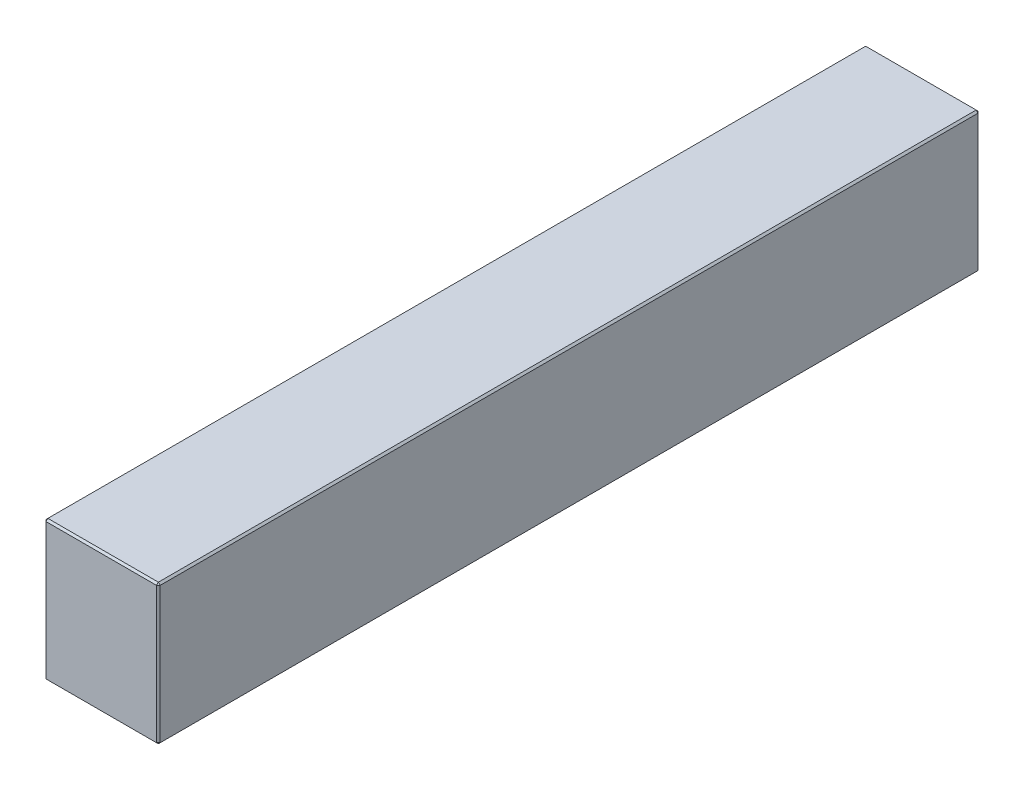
ISO-10303-21;
HEADER;
FILE_DESCRIPTION(('STEP AP214'),'2;1');
FILE_NAME('part.step','',(''),(''),'','','');
FILE_SCHEMA(('AUTOMOTIVE_DESIGN { 1 0 10303 214 1 1 1 1 }'));
ENDSEC;
DATA;
#1=APPLICATION_CONTEXT('core data for automotive mechanical design processes');
#2=APPLICATION_PROTOCOL_DEFINITION('international standard','automotive_design',2000,#1);
#3=PRODUCT_CONTEXT('',#1,'mechanical');
#4=PRODUCT('Part','Part','',(#3));
#5=PRODUCT_RELATED_PRODUCT_CATEGORY('part','',(#4));
#6=PRODUCT_DEFINITION_FORMATION('','',#4);
#7=PRODUCT_DEFINITION_CONTEXT('part definition',#1,'design');
#8=PRODUCT_DEFINITION('design','',#6,#7);
#9=PRODUCT_DEFINITION_SHAPE('','',#8);
#10=(LENGTH_UNIT() NAMED_UNIT(*) SI_UNIT(.MILLI.,.METRE.));
#11=(NAMED_UNIT(*) PLANE_ANGLE_UNIT() SI_UNIT($,.RADIAN.));
#12=(NAMED_UNIT(*) SI_UNIT($,.STERADIAN.) SOLID_ANGLE_UNIT());
#13=UNCERTAINTY_MEASURE_WITH_UNIT(LENGTH_MEASURE(1.E-05),#10,'distance_accuracy_value','');
#14=(GEOMETRIC_REPRESENTATION_CONTEXT(3) GLOBAL_UNCERTAINTY_ASSIGNED_CONTEXT((#13)) GLOBAL_UNIT_ASSIGNED_CONTEXT((#10,
#11,#12)) REPRESENTATION_CONTEXT('',''));
#15=CARTESIAN_POINT('',(0.,0.,0.));
#16=DIRECTION('',(0.,0.,1.));
#17=DIRECTION('',(1.,0.,0.));
#18=AXIS2_PLACEMENT_3D('',#15,#16,#17);
#19=CARTESIAN_POINT('',(-31.,76.,223.));
#20=DIRECTION('',(1.,0.,0.));
#21=DIRECTION('',(0.,0.,-1.));
#22=AXIS2_PLACEMENT_3D('',#19,#20,#21);
#23=PLANE('',#22);
#24=DIRECTION('',(0.,-1.,0.));
#25=VECTOR('',#24,1.);
#26=CARTESIAN_POINT('',(-31.,76.,-222.));
#27=LINE('',#26,#25);
#28=CARTESIAN_POINT('',(-31.,75.,-222.));
#29=VERTEX_POINT('',#28);
#30=CARTESIAN_POINT('',(-31.,1.00000000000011,-222.));
#31=VERTEX_POINT('',#30);
#32=EDGE_CURVE('E114',#29,#31,#27,.T.);
#33=ORIENTED_EDGE('',*,*,#32,.T.);
#34=DIRECTION('',(0.,0.,1.));
#35=VECTOR('',#34,1.);
#36=CARTESIAN_POINT('',(-31.,1.00000000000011,223.));
#37=LINE('',#36,#35);
#38=CARTESIAN_POINT('',(-31.,1.00000000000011,222.));
#39=VERTEX_POINT('',#38);
#40=EDGE_CURVE('E110',#31,#39,#37,.T.);
#41=ORIENTED_EDGE('',*,*,#40,.T.);
#42=DIRECTION('',(0.,1.,0.));
#43=VECTOR('',#42,1.);
#44=CARTESIAN_POINT('',(-31.,76.,222.));
#45=LINE('',#44,#43);
#46=CARTESIAN_POINT('',(-31.,75.,222.));
#47=VERTEX_POINT('',#46);
#48=EDGE_CURVE('E103',#39,#47,#45,.T.);
#49=ORIENTED_EDGE('',*,*,#48,.T.);
#50=DIRECTION('',(0.,0.,-1.));
#51=VECTOR('',#50,1.);
#52=CARTESIAN_POINT('',(-31.,75.,-223.));
#53=LINE('',#52,#51);
#54=EDGE_CURVE('E107',#47,#29,#53,.T.);
#55=ORIENTED_EDGE('',*,*,#54,.T.);
#56=EDGE_LOOP('',(#33,#41,#49,#55));
#57=FACE_BOUND('',#56,.T.);
#58=ADVANCED_FACE('F15',(#57),#23,.F.);
#59=CARTESIAN_POINT('',(31.,76.,223.));
#60=DIRECTION('',(0.,0.,-1.));
#61=DIRECTION('',(-1.,0.,0.));
#62=AXIS2_PLACEMENT_3D('',#59,#60,#61);
#63=PLANE('',#62);
#64=DIRECTION('',(-1.,0.,0.));
#65=VECTOR('',#64,1.);
#66=CARTESIAN_POINT('',(-31.,75.,223.));
#67=LINE('',#66,#65);
#68=CARTESIAN_POINT('',(30.,75.,223.));
#69=VERTEX_POINT('',#68);
#70=CARTESIAN_POINT('',(-30.,75.,223.));
#71=VERTEX_POINT('',#70);
#72=EDGE_CURVE('E164',#69,#71,#67,.T.);
#73=ORIENTED_EDGE('',*,*,#72,.T.);
#74=DIRECTION('',(0.,-1.,0.));
#75=VECTOR('',#74,1.);
#76=CARTESIAN_POINT('',(-30.,76.,223.));
#77=LINE('',#76,#75);
#78=CARTESIAN_POINT('',(-30.,1.00000000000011,223.));
#79=VERTEX_POINT('',#78);
#80=EDGE_CURVE('E122',#71,#79,#77,.T.);
#81=ORIENTED_EDGE('',*,*,#80,.T.);
#82=DIRECTION('',(1.,0.,0.));
#83=VECTOR('',#82,1.);
#84=CARTESIAN_POINT('',(31.,1.00000000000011,223.));
#85=LINE('',#84,#83);
#86=CARTESIAN_POINT('',(30.,1.00000000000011,223.));
#87=VERTEX_POINT('',#86);
#88=EDGE_CURVE('E168',#79,#87,#85,.T.);
#89=ORIENTED_EDGE('',*,*,#88,.T.);
#90=DIRECTION('',(0.,1.,0.));
#91=VECTOR('',#90,1.);
#92=CARTESIAN_POINT('',(30.,76.,223.));
#93=LINE('',#92,#91);
#94=EDGE_CURVE('E166',#87,#69,#93,.T.);
#95=ORIENTED_EDGE('',*,*,#94,.T.);
#96=EDGE_LOOP('',(#73,#81,#89,#95));
#97=FACE_BOUND('',#96,.T.);
#98=ADVANCED_FACE('F275',(#97),#63,.F.);
#99=CARTESIAN_POINT('',(31.,76.,223.));
#100=DIRECTION('',(-1.,0.,0.));
#101=DIRECTION('',(0.,0.,1.));
#102=AXIS2_PLACEMENT_3D('',#99,#100,#101);
#103=PLANE('',#102);
#104=DIRECTION('',(0.,0.,-1.));
#105=VECTOR('',#104,1.);
#106=CARTESIAN_POINT('',(31.,1.00000000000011,223.));
#107=LINE('',#106,#105);
#108=CARTESIAN_POINT('',(31.,1.00000000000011,222.));
#109=VERTEX_POINT('',#108);
#110=CARTESIAN_POINT('',(31.,1.00000000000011,-222.));
#111=VERTEX_POINT('',#110);
#112=EDGE_CURVE('E159',#109,#111,#107,.T.);
#113=ORIENTED_EDGE('',*,*,#112,.T.);
#114=DIRECTION('',(0.,1.,0.));
#115=VECTOR('',#114,1.);
#116=CARTESIAN_POINT('',(31.,76.,-222.));
#117=LINE('',#116,#115);
#118=CARTESIAN_POINT('',(31.,75.,-222.));
#119=VERTEX_POINT('',#118);
#120=EDGE_CURVE('E161',#111,#119,#117,.T.);
#121=ORIENTED_EDGE('',*,*,#120,.T.);
#122=DIRECTION('',(0.,0.,1.));
#123=VECTOR('',#122,1.);
#124=CARTESIAN_POINT('',(31.,75.,223.));
#125=LINE('',#124,#123);
#126=CARTESIAN_POINT('',(31.,75.,222.));
#127=VERTEX_POINT('',#126);
#128=EDGE_CURVE('E155',#119,#127,#125,.T.);
#129=ORIENTED_EDGE('',*,*,#128,.T.);
#130=DIRECTION('',(0.,-1.,0.));
#131=VECTOR('',#130,1.);
#132=CARTESIAN_POINT('',(31.,76.,222.));
#133=LINE('',#132,#131);
#134=EDGE_CURVE('E157',#127,#109,#133,.T.);
#135=ORIENTED_EDGE('',*,*,#134,.T.);
#136=EDGE_LOOP('',(#113,#121,#129,#135));
#137=FACE_BOUND('',#136,.T.);
#138=ADVANCED_FACE('F254',(#137),#103,.F.);
#139=CARTESIAN_POINT('',(31.,76.,-223.));
#140=DIRECTION('',(0.,0.,1.));
#141=DIRECTION('',(1.,0.,0.));
#142=AXIS2_PLACEMENT_3D('',#139,#140,#141);
#143=PLANE('',#142);
#144=DIRECTION('',(0.,-1.,0.));
#145=VECTOR('',#144,1.);
#146=CARTESIAN_POINT('',(30.,76.,-223.));
#147=LINE('',#146,#145);
#148=CARTESIAN_POINT('',(30.,75.,-223.));
#149=VERTEX_POINT('',#148);
#150=CARTESIAN_POINT('',(30.,1.00000000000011,-223.));
#151=VERTEX_POINT('',#150);
#152=EDGE_CURVE('E148',#149,#151,#147,.T.);
#153=ORIENTED_EDGE('',*,*,#152,.T.);
#154=DIRECTION('',(-1.,0.,0.));
#155=VECTOR('',#154,1.);
#156=CARTESIAN_POINT('',(31.,1.00000000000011,-223.));
#157=LINE('',#156,#155);
#158=CARTESIAN_POINT('',(-30.,1.00000000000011,-223.));
#159=VERTEX_POINT('',#158);
#160=EDGE_CURVE('E153',#151,#159,#157,.T.);
#161=ORIENTED_EDGE('',*,*,#160,.T.);
#162=DIRECTION('',(0.,1.,0.));
#163=VECTOR('',#162,1.);
#164=CARTESIAN_POINT('',(-30.,76.,-223.));
#165=LINE('',#164,#163);
#166=CARTESIAN_POINT('',(-30.,75.,-223.));
#167=VERTEX_POINT('',#166);
#168=EDGE_CURVE('E150',#159,#167,#165,.T.);
#169=ORIENTED_EDGE('',*,*,#168,.T.);
#170=DIRECTION('',(1.,0.,0.));
#171=VECTOR('',#170,1.);
#172=CARTESIAN_POINT('',(31.,75.,-223.));
#173=LINE('',#172,#171);
#174=EDGE_CURVE('E146',#167,#149,#173,.T.);
#175=ORIENTED_EDGE('',*,*,#174,.T.);
#176=EDGE_LOOP('',(#153,#161,#169,#175));
#177=FACE_BOUND('',#176,.T.);
#178=ADVANCED_FACE('F284',(#177),#143,.F.);
#179=CARTESIAN_POINT('',(0.,76.,0.));
#180=DIRECTION('',(0.,1.,0.));
#181=DIRECTION('',(0.,0.,1.));
#182=AXIS2_PLACEMENT_3D('',#179,#180,#181);
#183=PLANE('',#182);
#184=DIRECTION('',(0.,0.,-1.));
#185=VECTOR('',#184,1.);
#186=CARTESIAN_POINT('',(30.,76.,-223.));
#187=LINE('',#186,#185);
#188=CARTESIAN_POINT('',(30.,76.,222.));
#189=VERTEX_POINT('',#188);
#190=CARTESIAN_POINT('',(30.,76.,-222.));
#191=VERTEX_POINT('',#190);
#192=EDGE_CURVE('E24',#189,#191,#187,.T.);
#193=ORIENTED_EDGE('',*,*,#192,.T.);
#194=DIRECTION('',(-1.,0.,0.));
#195=VECTOR('',#194,1.);
#196=CARTESIAN_POINT('',(-31.,76.,-222.));
#197=LINE('',#196,#195);
#198=CARTESIAN_POINT('',(-30.,76.,-222.));
#199=VERTEX_POINT('',#198);
#200=EDGE_CURVE('E9',#191,#199,#197,.T.);
#201=ORIENTED_EDGE('',*,*,#200,.T.);
#202=DIRECTION('',(0.,0.,1.));
#203=VECTOR('',#202,1.);
#204=CARTESIAN_POINT('',(-30.,76.,223.));
#205=LINE('',#204,#203);
#206=CARTESIAN_POINT('',(-30.,76.,222.));
#207=VERTEX_POINT('',#206);
#208=EDGE_CURVE('E180',#199,#207,#205,.T.);
#209=ORIENTED_EDGE('',*,*,#208,.T.);
#210=DIRECTION('',(1.,0.,0.));
#211=VECTOR('',#210,1.);
#212=CARTESIAN_POINT('',(31.,76.,222.));
#213=LINE('',#212,#211);
#214=EDGE_CURVE('E35',#207,#189,#213,.T.);
#215=ORIENTED_EDGE('',*,*,#214,.T.);
#216=EDGE_LOOP('',(#193,#201,#209,#215));
#217=FACE_BOUND('',#216,.T.);
#218=ADVANCED_FACE('F350',(#217),#183,.T.);
#219=CARTESIAN_POINT('',(0.,0.,0.));
#220=DIRECTION('',(0.,1.,0.));
#221=DIRECTION('',(0.,0.,1.));
#222=AXIS2_PLACEMENT_3D('',#219,#220,#221);
#223=PLANE('',#222);
#224=DIRECTION('',(0.,0.,1.));
#225=VECTOR('',#224,1.);
#226=CARTESIAN_POINT('',(30.,0.,0.));
#227=LINE('',#226,#225);
#228=CARTESIAN_POINT('',(30.,0.,-222.));
#229=VERTEX_POINT('',#228);
#230=CARTESIAN_POINT('',(30.,0.,222.));
#231=VERTEX_POINT('',#230);
#232=EDGE_CURVE('E171',#229,#231,#227,.T.);
#233=ORIENTED_EDGE('',*,*,#232,.T.);
#234=DIRECTION('',(-1.,0.,0.));
#235=VECTOR('',#234,1.);
#236=CARTESIAN_POINT('',(0.,0.,222.));
#237=LINE('',#236,#235);
#238=CARTESIAN_POINT('',(-30.,0.,222.));
#239=VERTEX_POINT('',#238);
#240=EDGE_CURVE('E177',#231,#239,#237,.T.);
#241=ORIENTED_EDGE('',*,*,#240,.T.);
#242=DIRECTION('',(0.,0.,-1.));
#243=VECTOR('',#242,1.);
#244=CARTESIAN_POINT('',(-30.,0.,0.));
#245=LINE('',#244,#243);
#246=CARTESIAN_POINT('',(-30.,0.,-222.));
#247=VERTEX_POINT('',#246);
#248=EDGE_CURVE('E175',#239,#247,#245,.T.);
#249=ORIENTED_EDGE('',*,*,#248,.T.);
#250=DIRECTION('',(1.,0.,0.));
#251=VECTOR('',#250,1.);
#252=CARTESIAN_POINT('',(0.,0.,-222.));
#253=LINE('',#252,#251);
#254=EDGE_CURVE('E173',#247,#229,#253,.T.);
#255=ORIENTED_EDGE('',*,*,#254,.T.);
#256=EDGE_LOOP('',(#233,#241,#249,#255));
#257=FACE_BOUND('',#256,.T.);
#258=ADVANCED_FACE('F246',(#257),#223,.F.);
#259=CARTESIAN_POINT('',(31.,76.,222.));
#260=DIRECTION('',(-0.707106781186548,0.,-0.707106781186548));
#261=DIRECTION('',(0.,-1.,0.));
#262=AXIS2_PLACEMENT_3D('',#259,#260,#261);
#263=PLANE('',#262);
#264=DIRECTION('',(-0.707106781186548,0.,0.707106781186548));
#265=VECTOR('',#264,1.);
#266=CARTESIAN_POINT('',(30.,75.,223.));
#267=LINE('',#266,#265);
#268=EDGE_CURVE('E19',#69,#127,#267,.F.);
#269=ORIENTED_EDGE('',*,*,#268,.F.);
#270=ORIENTED_EDGE('',*,*,#94,.F.);
#271=DIRECTION('',(0.707106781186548,0.,-0.707106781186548));
#272=VECTOR('',#271,1.);
#273=CARTESIAN_POINT('',(30.,1.00000000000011,223.));
#274=LINE('',#273,#272);
#275=EDGE_CURVE('E142',#109,#87,#274,.F.);
#276=ORIENTED_EDGE('',*,*,#275,.F.);
#277=ORIENTED_EDGE('',*,*,#134,.F.);
#278=EDGE_LOOP('',(#269,#270,#276,#277));
#279=FACE_BOUND('',#278,.T.);
#280=ADVANCED_FACE('F17',(#279),#263,.F.);
#281=CARTESIAN_POINT('',(30.,75.,223.));
#282=DIRECTION('',(0.577350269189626,0.577350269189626,0.577350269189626));
#283=DIRECTION('',(0.707106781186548,0.,-0.707106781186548));
#284=AXIS2_PLACEMENT_3D('',#281,#282,#283);
#285=PLANE('',#284);
#286=DIRECTION('',(0.,-0.707106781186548,0.707106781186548));
#287=VECTOR('',#286,1.);
#288=CARTESIAN_POINT('',(30.,75.,223.));
#289=LINE('',#288,#287);
#290=EDGE_CURVE('E226',#69,#189,#289,.F.);
#291=ORIENTED_EDGE('',*,*,#290,.F.);
#292=ORIENTED_EDGE('',*,*,#268,.T.);
#293=DIRECTION('',(-0.707106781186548,0.707106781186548,0.));
#294=VECTOR('',#293,1.);
#295=CARTESIAN_POINT('',(30.5,75.5,222.));
#296=LINE('',#295,#294);
#297=EDGE_CURVE('E228',#189,#127,#296,.F.);
#298=ORIENTED_EDGE('',*,*,#297,.F.);
#299=EDGE_LOOP('',(#291,#292,#298));
#300=FACE_BOUND('',#299,.T.);
#301=ADVANCED_FACE('F270',(#300),#285,.T.);
#302=CARTESIAN_POINT('',(30.,1.00000000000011,223.));
#303=DIRECTION('',(0.577350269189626,-0.577350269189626,0.577350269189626));
#304=DIRECTION('',(0.707106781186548,0.,-0.707106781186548));
#305=AXIS2_PLACEMENT_3D('',#302,#303,#304);
#306=PLANE('',#305);
#307=DIRECTION('',(-0.707106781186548,-0.707106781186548,0.));
#308=VECTOR('',#307,1.);
#309=CARTESIAN_POINT('',(30.5,0.500000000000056,222.));
#310=LINE('',#309,#308);
#311=EDGE_CURVE('E220',#109,#231,#310,.T.);
#312=ORIENTED_EDGE('',*,*,#311,.F.);
#313=ORIENTED_EDGE('',*,*,#275,.T.);
#314=DIRECTION('',(0.,0.707106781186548,0.707106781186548));
#315=VECTOR('',#314,1.);
#316=CARTESIAN_POINT('',(30.,1.00000000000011,223.));
#317=LINE('',#316,#315);
#318=EDGE_CURVE('E223',#231,#87,#317,.T.);
#319=ORIENTED_EDGE('',*,*,#318,.F.);
#320=EDGE_LOOP('',(#312,#313,#319));
#321=FACE_BOUND('',#320,.T.);
#322=ADVANCED_FACE('F235',(#321),#306,.T.);
#323=CARTESIAN_POINT('',(30.,76.,0.));
#324=DIRECTION('',(0.707106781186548,0.707106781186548,0.));
#325=DIRECTION('',(0.,0.,1.));
#326=AXIS2_PLACEMENT_3D('',#323,#324,#325);
#327=PLANE('',#326);
#328=ORIENTED_EDGE('',*,*,#297,.T.);
#329=ORIENTED_EDGE('',*,*,#128,.F.);
#330=DIRECTION('',(0.707106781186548,-0.707106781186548,0.));
#331=VECTOR('',#330,1.);
#332=CARTESIAN_POINT('',(31.,75.,-222.));
#333=LINE('',#332,#331);
#334=EDGE_CURVE('E215',#191,#119,#333,.T.);
#335=ORIENTED_EDGE('',*,*,#334,.F.);
#336=ORIENTED_EDGE('',*,*,#192,.F.);
#337=EDGE_LOOP('',(#328,#329,#335,#336));
#338=FACE_BOUND('',#337,.T.);
#339=ADVANCED_FACE('F265',(#338),#327,.T.);
#340=CARTESIAN_POINT('',(0.,76.,222.));
#341=DIRECTION('',(0.,0.707106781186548,0.707106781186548));
#342=DIRECTION('',(-1.,0.,0.));
#343=AXIS2_PLACEMENT_3D('',#340,#341,#342);
#344=PLANE('',#343);
#345=ORIENTED_EDGE('',*,*,#290,.T.);
#346=ORIENTED_EDGE('',*,*,#214,.F.);
#347=DIRECTION('',(0.,0.707106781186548,-0.707106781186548));
#348=VECTOR('',#347,1.);
#349=CARTESIAN_POINT('',(-30.,75.5,222.5));
#350=LINE('',#349,#348);
#351=EDGE_CURVE('E126',#71,#207,#350,.T.);
#352=ORIENTED_EDGE('',*,*,#351,.F.);
#353=ORIENTED_EDGE('',*,*,#72,.F.);
#354=EDGE_LOOP('',(#345,#346,#352,#353));
#355=FACE_BOUND('',#354,.T.);
#356=ADVANCED_FACE('F273',(#355),#344,.T.);
#357=CARTESIAN_POINT('',(-30.,76.,223.));
#358=DIRECTION('',(0.707106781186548,0.,-0.707106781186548));
#359=DIRECTION('',(0.,-1.,0.));
#360=AXIS2_PLACEMENT_3D('',#357,#358,#359);
#361=PLANE('',#360);
#362=DIRECTION('',(0.707106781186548,0.,0.707106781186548));
#363=VECTOR('',#362,1.);
#364=CARTESIAN_POINT('',(-30.,1.00000000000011,223.));
#365=LINE('',#364,#363);
#366=EDGE_CURVE('E127',#79,#39,#365,.F.);
#367=ORIENTED_EDGE('',*,*,#366,.F.);
#368=ORIENTED_EDGE('',*,*,#80,.F.);
#369=DIRECTION('',(-0.707106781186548,0.,-0.707106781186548));
#370=VECTOR('',#369,1.);
#371=CARTESIAN_POINT('',(-31.,75.,222.));
#372=LINE('',#371,#370);
#373=EDGE_CURVE('E118',#47,#71,#372,.F.);
#374=ORIENTED_EDGE('',*,*,#373,.F.);
#375=ORIENTED_EDGE('',*,*,#48,.F.);
#376=EDGE_LOOP('',(#367,#368,#374,#375));
#377=FACE_BOUND('',#376,.T.);
#378=ADVANCED_FACE('F120',(#377),#361,.F.);
#379=CARTESIAN_POINT('',(31.,1.00000000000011,223.));
#380=DIRECTION('',(0.,0.707106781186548,-0.707106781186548));
#381=DIRECTION('',(1.,0.,0.));
#382=AXIS2_PLACEMENT_3D('',#379,#380,#381);
#383=PLANE('',#382);
#384=ORIENTED_EDGE('',*,*,#318,.T.);
#385=ORIENTED_EDGE('',*,*,#88,.F.);
#386=DIRECTION('',(0.,-0.707106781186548,-0.707106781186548));
#387=VECTOR('',#386,1.);
#388=CARTESIAN_POINT('',(-30.,1.00000000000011,223.));
#389=LINE('',#388,#387);
#390=EDGE_CURVE('E211',#239,#79,#389,.F.);
#391=ORIENTED_EDGE('',*,*,#390,.F.);
#392=ORIENTED_EDGE('',*,*,#240,.F.);
#393=EDGE_LOOP('',(#384,#385,#391,#392));
#394=FACE_BOUND('',#393,.T.);
#395=ADVANCED_FACE('F243',(#394),#383,.F.);
#396=CARTESIAN_POINT('',(31.,1.00000000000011,223.));
#397=DIRECTION('',(-0.707106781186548,0.707106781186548,0.));
#398=DIRECTION('',(0.,0.,-1.));
#399=AXIS2_PLACEMENT_3D('',#396,#397,#398);
#400=PLANE('',#399);
#401=ORIENTED_EDGE('',*,*,#311,.T.);
#402=ORIENTED_EDGE('',*,*,#232,.F.);
#403=DIRECTION('',(0.707106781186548,0.707106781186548,0.));
#404=VECTOR('',#403,1.);
#405=CARTESIAN_POINT('',(30.5,0.500000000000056,-222.));
#406=LINE('',#405,#404);
#407=EDGE_CURVE('E208',#111,#229,#406,.F.);
#408=ORIENTED_EDGE('',*,*,#407,.F.);
#409=ORIENTED_EDGE('',*,*,#112,.F.);
#410=EDGE_LOOP('',(#401,#402,#408,#409));
#411=FACE_BOUND('',#410,.T.);
#412=ADVANCED_FACE('F251',(#411),#400,.F.);
#413=CARTESIAN_POINT('',(30.,76.,-223.));
#414=DIRECTION('',(-0.707106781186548,0.,0.707106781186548));
#415=DIRECTION('',(0.,-1.,0.));
#416=AXIS2_PLACEMENT_3D('',#413,#414,#415);
#417=PLANE('',#416);
#418=DIRECTION('',(0.707106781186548,0.,0.707106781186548));
#419=VECTOR('',#418,1.);
#420=CARTESIAN_POINT('',(31.,75.,-222.));
#421=LINE('',#420,#419);
#422=EDGE_CURVE('E217',#119,#149,#421,.F.);
#423=ORIENTED_EDGE('',*,*,#422,.F.);
#424=ORIENTED_EDGE('',*,*,#120,.F.);
#425=DIRECTION('',(-0.707106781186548,0.,-0.707106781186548));
#426=VECTOR('',#425,1.);
#427=CARTESIAN_POINT('',(30.,1.00000000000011,-223.));
#428=LINE('',#427,#426);
#429=EDGE_CURVE('E205',#151,#111,#428,.F.);
#430=ORIENTED_EDGE('',*,*,#429,.F.);
#431=ORIENTED_EDGE('',*,*,#152,.F.);
#432=EDGE_LOOP('',(#423,#424,#430,#431));
#433=FACE_BOUND('',#432,.T.);
#434=ADVANCED_FACE('F258',(#433),#417,.F.);
#435=CARTESIAN_POINT('',(31.,75.,-222.));
#436=DIRECTION('',(0.577350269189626,0.577350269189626,-0.577350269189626));
#437=DIRECTION('',(-0.707106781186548,0.,-0.707106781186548));
#438=AXIS2_PLACEMENT_3D('',#435,#436,#437);
#439=PLANE('',#438);
#440=ORIENTED_EDGE('',*,*,#334,.T.);
#441=ORIENTED_EDGE('',*,*,#422,.T.);
#442=DIRECTION('',(0.,0.707106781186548,0.707106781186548));
#443=VECTOR('',#442,1.);
#444=CARTESIAN_POINT('',(30.,75.5,-222.5));
#445=LINE('',#444,#443);
#446=EDGE_CURVE('E134',#191,#149,#445,.F.);
#447=ORIENTED_EDGE('',*,*,#446,.F.);
#448=EDGE_LOOP('',(#440,#441,#447));
#449=FACE_BOUND('',#448,.T.);
#450=ADVANCED_FACE('F325',(#449),#439,.T.);
#451=CARTESIAN_POINT('',(-31.,75.,222.));
#452=DIRECTION('',(-0.577350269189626,0.577350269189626,0.577350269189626));
#453=DIRECTION('',(0.707106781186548,0.,0.707106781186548));
#454=AXIS2_PLACEMENT_3D('',#451,#452,#453);
#455=PLANE('',#454);
#456=ORIENTED_EDGE('',*,*,#373,.T.);
#457=ORIENTED_EDGE('',*,*,#351,.T.);
#458=DIRECTION('',(-0.707106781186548,-0.707106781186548,0.));
#459=VECTOR('',#458,1.);
#460=CARTESIAN_POINT('',(-31.,75.,222.));
#461=LINE('',#460,#459);
#462=EDGE_CURVE('E130',#47,#207,#461,.F.);
#463=ORIENTED_EDGE('',*,*,#462,.F.);
#464=EDGE_LOOP('',(#456,#457,#463));
#465=FACE_BOUND('',#464,.T.);
#466=ADVANCED_FACE('F131',(#465),#455,.T.);
#467=CARTESIAN_POINT('',(-30.,1.00000000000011,223.));
#468=DIRECTION('',(-0.577350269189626,-0.577350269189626,0.577350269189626));
#469=DIRECTION('',(0.707106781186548,0.,0.707106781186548));
#470=AXIS2_PLACEMENT_3D('',#467,#468,#469);
#471=PLANE('',#470);
#472=ORIENTED_EDGE('',*,*,#390,.T.);
#473=ORIENTED_EDGE('',*,*,#366,.T.);
#474=DIRECTION('',(-0.707106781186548,0.707106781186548,0.));
#475=VECTOR('',#474,1.);
#476=CARTESIAN_POINT('',(-30.5,0.500000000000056,222.));
#477=LINE('',#476,#475);
#478=EDGE_CURVE('E135',#239,#39,#477,.T.);
#479=ORIENTED_EDGE('',*,*,#478,.F.);
#480=EDGE_LOOP('',(#472,#473,#479));
#481=FACE_BOUND('',#480,.T.);
#482=ADVANCED_FACE('F318',(#481),#471,.T.);
#483=CARTESIAN_POINT('',(30.,1.00000000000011,-223.));
#484=DIRECTION('',(0.577350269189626,-0.577350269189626,-0.577350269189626));
#485=DIRECTION('',(-0.707106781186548,0.,-0.707106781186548));
#486=AXIS2_PLACEMENT_3D('',#483,#484,#485);
#487=PLANE('',#486);
#488=ORIENTED_EDGE('',*,*,#429,.T.);
#489=ORIENTED_EDGE('',*,*,#407,.T.);
#490=DIRECTION('',(0.,-0.707106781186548,0.707106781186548));
#491=VECTOR('',#490,1.);
#492=CARTESIAN_POINT('',(30.,1.00000000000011,-223.));
#493=LINE('',#492,#491);
#494=EDGE_CURVE('E198',#151,#229,#493,.T.);
#495=ORIENTED_EDGE('',*,*,#494,.F.);
#496=EDGE_LOOP('',(#488,#489,#495));
#497=FACE_BOUND('',#496,.T.);
#498=ADVANCED_FACE('F314',(#497),#487,.T.);
#499=CARTESIAN_POINT('',(0.,76.,-222.));
#500=DIRECTION('',(0.,0.707106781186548,-0.707106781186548));
#501=DIRECTION('',(1.,0.,0.));
#502=AXIS2_PLACEMENT_3D('',#499,#500,#501);
#503=PLANE('',#502);
#504=ORIENTED_EDGE('',*,*,#446,.T.);
#505=ORIENTED_EDGE('',*,*,#174,.F.);
#506=DIRECTION('',(0.,-0.707106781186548,-0.707106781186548));
#507=VECTOR('',#506,1.);
#508=CARTESIAN_POINT('',(-30.,75.,-223.));
#509=LINE('',#508,#507);
#510=EDGE_CURVE('E195',#199,#167,#509,.T.);
#511=ORIENTED_EDGE('',*,*,#510,.F.);
#512=ORIENTED_EDGE('',*,*,#200,.F.);
#513=EDGE_LOOP('',(#504,#505,#511,#512));
#514=FACE_BOUND('',#513,.T.);
#515=ADVANCED_FACE('F311',(#514),#503,.T.);
#516=CARTESIAN_POINT('',(-30.,76.,0.));
#517=DIRECTION('',(-0.707106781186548,0.707106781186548,0.));
#518=DIRECTION('',(0.,0.,-1.));
#519=AXIS2_PLACEMENT_3D('',#516,#517,#518);
#520=PLANE('',#519);
#521=ORIENTED_EDGE('',*,*,#462,.T.);
#522=ORIENTED_EDGE('',*,*,#208,.F.);
#523=DIRECTION('',(0.707106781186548,0.707106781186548,0.));
#524=VECTOR('',#523,1.);
#525=CARTESIAN_POINT('',(-30.5,75.5,-222.));
#526=LINE('',#525,#524);
#527=EDGE_CURVE('E138',#29,#199,#526,.T.);
#528=ORIENTED_EDGE('',*,*,#527,.F.);
#529=ORIENTED_EDGE('',*,*,#54,.F.);
#530=EDGE_LOOP('',(#521,#522,#528,#529));
#531=FACE_BOUND('',#530,.T.);
#532=ADVANCED_FACE('F137',(#531),#520,.T.);
#533=CARTESIAN_POINT('',(-31.,1.00000000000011,223.));
#534=DIRECTION('',(0.707106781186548,0.707106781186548,0.));
#535=DIRECTION('',(0.,0.,1.));
#536=AXIS2_PLACEMENT_3D('',#533,#534,#535);
#537=PLANE('',#536);
#538=ORIENTED_EDGE('',*,*,#478,.T.);
#539=ORIENTED_EDGE('',*,*,#40,.F.);
#540=DIRECTION('',(0.707106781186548,-0.707106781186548,0.));
#541=VECTOR('',#540,1.);
#542=CARTESIAN_POINT('',(-31.,1.00000000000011,-222.));
#543=LINE('',#542,#541);
#544=EDGE_CURVE('E191',#247,#31,#543,.F.);
#545=ORIENTED_EDGE('',*,*,#544,.F.);
#546=ORIENTED_EDGE('',*,*,#248,.F.);
#547=EDGE_LOOP('',(#538,#539,#545,#546));
#548=FACE_BOUND('',#547,.T.);
#549=ADVANCED_FACE('F304',(#548),#537,.F.);
#550=CARTESIAN_POINT('',(31.,1.00000000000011,-223.));
#551=DIRECTION('',(0.,0.707106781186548,0.707106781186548));
#552=DIRECTION('',(-1.,0.,0.));
#553=AXIS2_PLACEMENT_3D('',#550,#551,#552);
#554=PLANE('',#553);
#555=ORIENTED_EDGE('',*,*,#494,.T.);
#556=ORIENTED_EDGE('',*,*,#254,.F.);
#557=DIRECTION('',(0.,0.707106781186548,-0.707106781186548));
#558=VECTOR('',#557,1.);
#559=CARTESIAN_POINT('',(-30.,0.500000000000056,-222.5));
#560=LINE('',#559,#558);
#561=EDGE_CURVE('E188',#159,#247,#560,.F.);
#562=ORIENTED_EDGE('',*,*,#561,.F.);
#563=ORIENTED_EDGE('',*,*,#160,.F.);
#564=EDGE_LOOP('',(#555,#556,#562,#563));
#565=FACE_BOUND('',#564,.T.);
#566=ADVANCED_FACE('F300',(#565),#554,.F.);
#567=CARTESIAN_POINT('',(-30.,75.,-223.));
#568=DIRECTION('',(-0.577350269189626,0.577350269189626,-0.577350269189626));
#569=DIRECTION('',(-0.707106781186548,0.,0.707106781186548));
#570=AXIS2_PLACEMENT_3D('',#567,#568,#569);
#571=PLANE('',#570);
#572=ORIENTED_EDGE('',*,*,#527,.T.);
#573=ORIENTED_EDGE('',*,*,#510,.T.);
#574=DIRECTION('',(0.707106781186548,0.,-0.707106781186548));
#575=VECTOR('',#574,1.);
#576=CARTESIAN_POINT('',(-30.,75.,-223.));
#577=LINE('',#576,#575);
#578=EDGE_CURVE('E186',#29,#167,#577,.T.);
#579=ORIENTED_EDGE('',*,*,#578,.F.);
#580=EDGE_LOOP('',(#572,#573,#579));
#581=FACE_BOUND('',#580,.T.);
#582=ADVANCED_FACE('F296',(#581),#571,.T.);
#583=CARTESIAN_POINT('',(-31.,1.00000000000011,-222.));
#584=DIRECTION('',(-0.577350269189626,-0.577350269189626,-0.577350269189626));
#585=DIRECTION('',(-0.707106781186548,0.,0.707106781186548));
#586=AXIS2_PLACEMENT_3D('',#583,#584,#585);
#587=PLANE('',#586);
#588=ORIENTED_EDGE('',*,*,#561,.T.);
#589=ORIENTED_EDGE('',*,*,#544,.T.);
#590=DIRECTION('',(-0.707106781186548,0.,0.707106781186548));
#591=VECTOR('',#590,1.);
#592=CARTESIAN_POINT('',(-31.,1.00000000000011,-222.));
#593=LINE('',#592,#591);
#594=EDGE_CURVE('E184',#159,#31,#593,.T.);
#595=ORIENTED_EDGE('',*,*,#594,.F.);
#596=EDGE_LOOP('',(#588,#589,#595));
#597=FACE_BOUND('',#596,.T.);
#598=ADVANCED_FACE('F292',(#597),#587,.T.);
#599=CARTESIAN_POINT('',(-31.,76.,-222.));
#600=DIRECTION('',(0.707106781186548,0.,0.707106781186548));
#601=DIRECTION('',(0.,-1.,0.));
#602=AXIS2_PLACEMENT_3D('',#599,#600,#601);
#603=PLANE('',#602);
#604=ORIENTED_EDGE('',*,*,#578,.T.);
#605=ORIENTED_EDGE('',*,*,#168,.F.);
#606=ORIENTED_EDGE('',*,*,#594,.T.);
#607=ORIENTED_EDGE('',*,*,#32,.F.);
#608=EDGE_LOOP('',(#604,#605,#606,#607));
#609=FACE_BOUND('',#608,.T.);
#610=ADVANCED_FACE('F289',(#609),#603,.F.);
#611=CLOSED_SHELL('',(#58,#98,#138,#178,#218,#258,#280,#301,#322,#339,#356,#378,#395,#412,#434,
#450,#466,#482,#498,#515,#532,#549,#566,#582,#598,#610));
#612=MANIFOLD_SOLID_BREP('B1',#611);
#613=ADVANCED_BREP_SHAPE_REPRESENTATION('',(#18,#612),#14);
#614=SHAPE_DEFINITION_REPRESENTATION(#9,#613);
ENDSEC;
END-ISO-10303-21;
